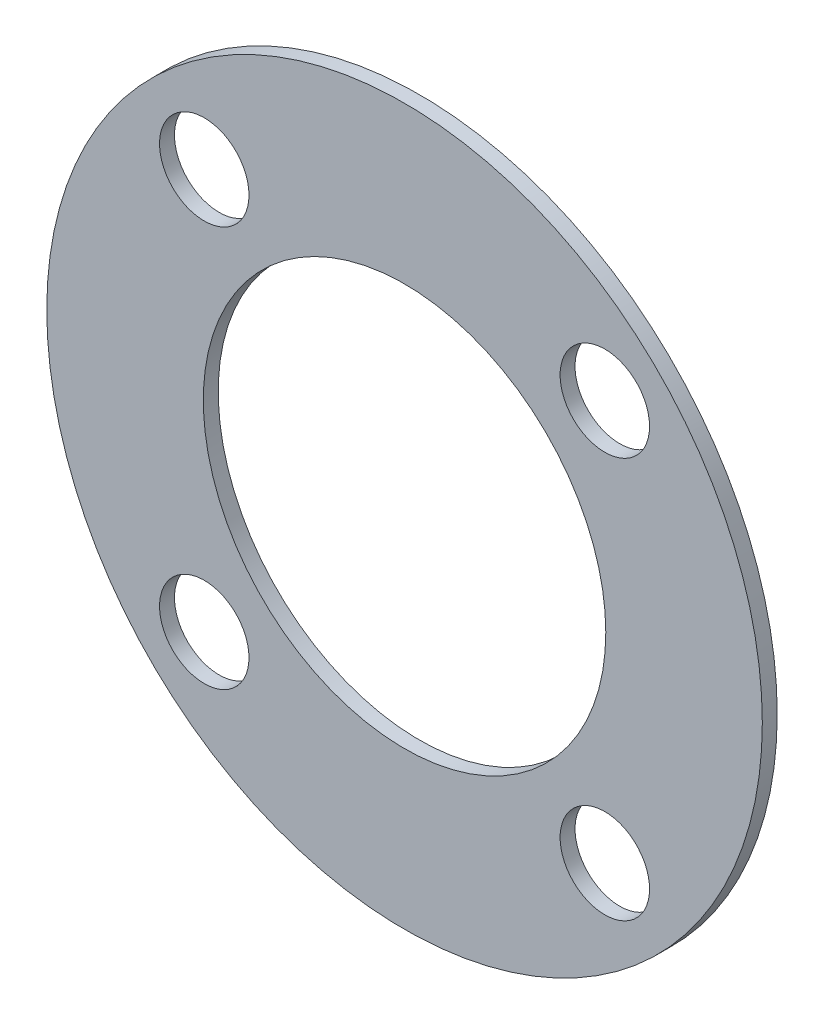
from build123d import *

# Parameters (mm, degrees)
SKETCH1_R      = 76.2
SKETCH1_R_2    = 42.8625
SKETCH1_R_3    = 9.525
EXTRUDE1_DEPTH = 3.175


with BuildPart() as part:
    # Sketch1 → Extrude1 (new body)
    with BuildSketch(Plane.XY):
        with Locations((0, -201.6125)):
            Circle(SKETCH1_R)
        with Locations((0, -201.6125)):
            Circle(SKETCH1_R_2, mode=Mode.SUBTRACT)
        with Locations((42.656216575, -244.268716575)):
            Circle(SKETCH1_R_3, mode=Mode.SUBTRACT)
        with Locations((-42.656216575, -244.268716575)):
            Circle(SKETCH1_R_3, mode=Mode.SUBTRACT)
        with Locations((-42.656216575, -158.956283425)):
            Circle(SKETCH1_R_3, mode=Mode.SUBTRACT)
        with Locations((42.656216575, -158.956283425)):
            Circle(SKETCH1_R_3, mode=Mode.SUBTRACT)
    extrude(amount=EXTRUDE1_DEPTH)


solid = part.part
